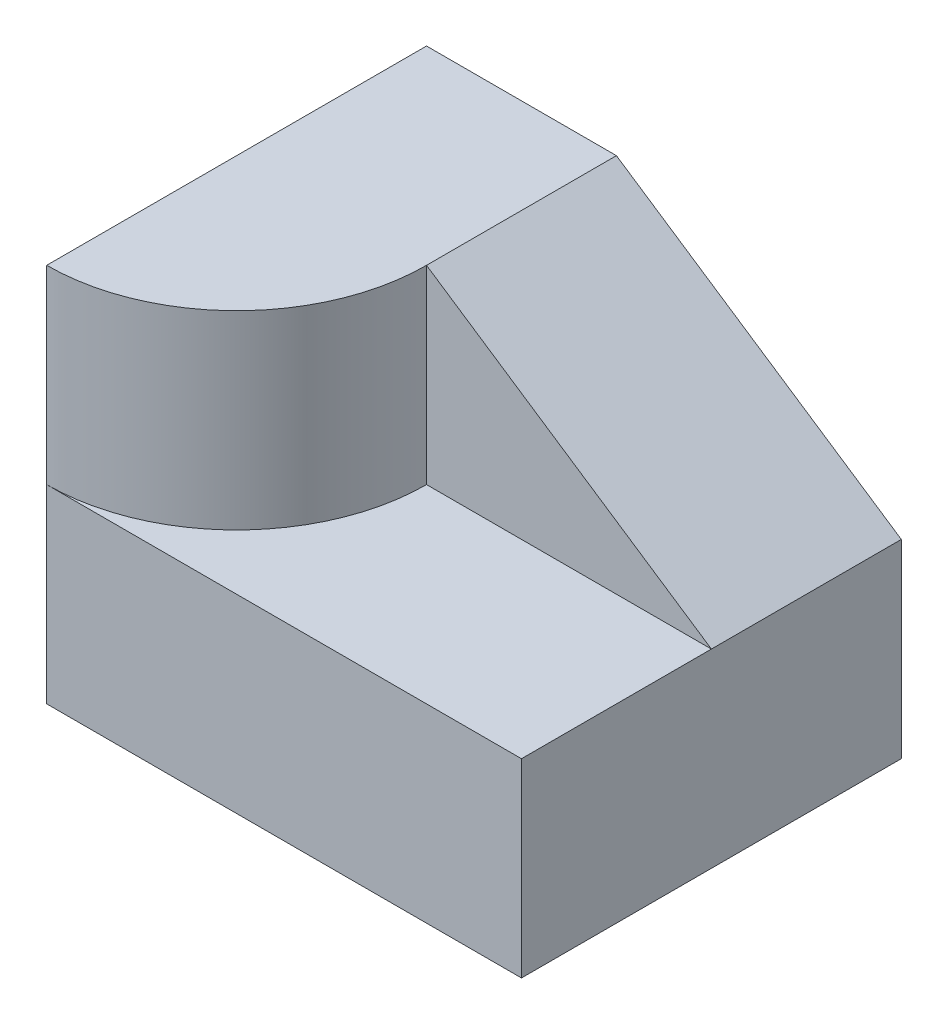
ISO-10303-21;
HEADER;
FILE_DESCRIPTION(('STEP AP214'),'2;1');
FILE_NAME('part.step','',(''),(''),'','','');
FILE_SCHEMA(('AUTOMOTIVE_DESIGN { 1 0 10303 214 1 1 1 1 }'));
ENDSEC;
DATA;
#1=APPLICATION_CONTEXT('core data for automotive mechanical design processes');
#2=APPLICATION_PROTOCOL_DEFINITION('international standard','automotive_design',2000,#1);
#3=PRODUCT_CONTEXT('',#1,'mechanical');
#4=PRODUCT('Part','Part','',(#3));
#5=PRODUCT_RELATED_PRODUCT_CATEGORY('part','',(#4));
#6=PRODUCT_DEFINITION_FORMATION('','',#4);
#7=PRODUCT_DEFINITION_CONTEXT('part definition',#1,'design');
#8=PRODUCT_DEFINITION('design','',#6,#7);
#9=PRODUCT_DEFINITION_SHAPE('','',#8);
#10=(LENGTH_UNIT() NAMED_UNIT(*) SI_UNIT(.MILLI.,.METRE.));
#11=(NAMED_UNIT(*) PLANE_ANGLE_UNIT() SI_UNIT($,.RADIAN.));
#12=(NAMED_UNIT(*) SI_UNIT($,.STERADIAN.) SOLID_ANGLE_UNIT());
#13=UNCERTAINTY_MEASURE_WITH_UNIT(LENGTH_MEASURE(1.E-05),#10,'distance_accuracy_value','');
#14=(GEOMETRIC_REPRESENTATION_CONTEXT(3) GLOBAL_UNCERTAINTY_ASSIGNED_CONTEXT((#13)) GLOBAL_UNIT_ASSIGNED_CONTEXT((#10,
#11,#12)) REPRESENTATION_CONTEXT('',''));
#15=CARTESIAN_POINT('',(0.,0.,0.));
#16=DIRECTION('',(0.,0.,1.));
#17=DIRECTION('',(1.,0.,0.));
#18=AXIS2_PLACEMENT_3D('',#15,#16,#17);
#19=CARTESIAN_POINT('',(25.,20.,20.));
#20=DIRECTION('',(0.,-1.,0.));
#21=DIRECTION('',(1.,0.,0.));
#22=AXIS2_PLACEMENT_3D('',#19,#20,#21);
#23=PLANE('',#22);
#24=DIRECTION('',(0.,0.,-1.));
#25=VECTOR('',#24,1.);
#26=CARTESIAN_POINT('',(50.,20.,20.));
#27=LINE('',#26,#25);
#28=CARTESIAN_POINT('',(50.,20.,20.));
#29=VERTEX_POINT('',#28);
#30=CARTESIAN_POINT('',(50.,20.,0.));
#31=VERTEX_POINT('',#30);
#32=EDGE_CURVE('E132',#29,#31,#27,.T.);
#33=ORIENTED_EDGE('',*,*,#32,.T.);
#34=DIRECTION('',(-1.,0.,0.));
#35=VECTOR('',#34,1.);
#36=CARTESIAN_POINT('',(25.,20.,0.));
#37=LINE('',#36,#35);
#38=CARTESIAN_POINT('',(20.,20.,0.));
#39=VERTEX_POINT('',#38);
#40=EDGE_CURVE('E113',#31,#39,#37,.T.);
#41=ORIENTED_EDGE('',*,*,#40,.T.);
#42=CARTESIAN_POINT('',(0.,20.,0.));
#43=DIRECTION('',(0.,-1.,0.));
#44=DIRECTION('',(1.,0.,0.));
#45=AXIS2_PLACEMENT_3D('',#42,#43,#44);
#46=CIRCLE('',#45,20.);
#47=CARTESIAN_POINT('',(0.,20.,20.));
#48=VERTEX_POINT('',#47);
#49=EDGE_CURVE('E11',#39,#48,#46,.T.);
#50=ORIENTED_EDGE('',*,*,#49,.T.);
#51=DIRECTION('',(-1.,0.,0.));
#52=VECTOR('',#51,1.);
#53=CARTESIAN_POINT('',(25.,20.,20.));
#54=LINE('',#53,#52);
#55=EDGE_CURVE('E47',#29,#48,#54,.T.);
#56=ORIENTED_EDGE('',*,*,#55,.F.);
#57=EDGE_LOOP('',(#33,#41,#50,#56));
#58=FACE_BOUND('',#57,.T.);
#59=ADVANCED_FACE('F32',(#58),#23,.F.);
#60=CARTESIAN_POINT('',(50.,-29.9460396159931,20.));
#61=DIRECTION('',(-1.,0.,0.));
#62=DIRECTION('',(0.,0.,1.));
#63=AXIS2_PLACEMENT_3D('',#60,#61,#62);
#64=PLANE('',#63);
#65=DIRECTION('',(0.,1.,0.));
#66=VECTOR('',#65,1.);
#67=CARTESIAN_POINT('',(50.,-29.9460396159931,-20.));
#68=LINE('',#67,#66);
#69=CARTESIAN_POINT('',(50.,0.,-20.));
#70=VERTEX_POINT('',#69);
#71=CARTESIAN_POINT('',(50.,20.,-20.));
#72=VERTEX_POINT('',#71);
#73=EDGE_CURVE('E111',#70,#72,#68,.T.);
#74=ORIENTED_EDGE('',*,*,#73,.T.);
#75=DIRECTION('',(0.,0.,1.));
#76=VECTOR('',#75,1.);
#77=CARTESIAN_POINT('',(50.,20.,-20.));
#78=LINE('',#77,#76);
#79=EDGE_CURVE('E93',#72,#31,#78,.T.);
#80=ORIENTED_EDGE('',*,*,#79,.T.);
#81=ORIENTED_EDGE('',*,*,#32,.F.);
#82=DIRECTION('',(0.,1.,0.));
#83=VECTOR('',#82,1.);
#84=CARTESIAN_POINT('',(50.,-29.9460396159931,20.));
#85=LINE('',#84,#83);
#86=CARTESIAN_POINT('',(50.,0.,20.));
#87=VERTEX_POINT('',#86);
#88=EDGE_CURVE('E128',#87,#29,#85,.T.);
#89=ORIENTED_EDGE('',*,*,#88,.F.);
#90=DIRECTION('',(0.,0.,-1.));
#91=VECTOR('',#90,1.);
#92=CARTESIAN_POINT('',(50.,0.,20.));
#93=LINE('',#92,#91);
#94=EDGE_CURVE('E117',#87,#70,#93,.T.);
#95=ORIENTED_EDGE('',*,*,#94,.T.);
#96=EDGE_LOOP('',(#74,#80,#81,#89,#95));
#97=FACE_BOUND('',#96,.T.);
#98=ADVANCED_FACE('F115',(#97),#64,.F.);
#99=CARTESIAN_POINT('',(0.,-29.9460396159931,20.));
#100=DIRECTION('',(1.,0.,0.));
#101=DIRECTION('',(0.,1.,0.));
#102=AXIS2_PLACEMENT_3D('',#99,#100,#101);
#103=PLANE('',#102);
#104=DIRECTION('',(0.,-1.,0.));
#105=VECTOR('',#104,1.);
#106=CARTESIAN_POINT('',(0.,-29.9460396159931,-20.));
#107=LINE('',#106,#105);
#108=CARTESIAN_POINT('',(0.,40.,-20.));
#109=VERTEX_POINT('',#108);
#110=CARTESIAN_POINT('',(0.,0.,-20.));
#111=VERTEX_POINT('',#110);
#112=EDGE_CURVE('E118',#109,#111,#107,.T.);
#113=ORIENTED_EDGE('',*,*,#112,.T.);
#114=DIRECTION('',(0.,0.,-1.));
#115=VECTOR('',#114,1.);
#116=CARTESIAN_POINT('',(0.,0.,20.));
#117=LINE('',#116,#115);
#118=CARTESIAN_POINT('',(0.,0.,20.));
#119=VERTEX_POINT('',#118);
#120=EDGE_CURVE('E130',#119,#111,#117,.T.);
#121=ORIENTED_EDGE('',*,*,#120,.F.);
#122=DIRECTION('',(0.,-1.,0.));
#123=VECTOR('',#122,1.);
#124=CARTESIAN_POINT('',(0.,-29.9460396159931,20.));
#125=LINE('',#124,#123);
#126=EDGE_CURVE('E135',#48,#119,#125,.T.);
#127=ORIENTED_EDGE('',*,*,#126,.F.);
#128=CARTESIAN_POINT('',(0.,40.,20.));
#129=VERTEX_POINT('',#128);
#130=EDGE_CURVE('E138',#129,#48,#125,.T.);
#131=ORIENTED_EDGE('',*,*,#130,.F.);
#132=DIRECTION('',(0.,0.,-1.));
#133=VECTOR('',#132,1.);
#134=CARTESIAN_POINT('',(0.,40.,20.));
#135=LINE('',#134,#133);
#136=EDGE_CURVE('E119',#129,#109,#135,.T.);
#137=ORIENTED_EDGE('',*,*,#136,.T.);
#138=EDGE_LOOP('',(#113,#121,#127,#131,#137));
#139=FACE_BOUND('',#138,.T.);
#140=ADVANCED_FACE('F146',(#139),#103,.F.);
#141=CARTESIAN_POINT('',(25.,0.,20.));
#142=DIRECTION('',(0.,1.,0.));
#143=DIRECTION('',(0.,0.,1.));
#144=AXIS2_PLACEMENT_3D('',#141,#142,#143);
#145=PLANE('',#144);
#146=DIRECTION('',(1.,0.,0.));
#147=VECTOR('',#146,1.);
#148=CARTESIAN_POINT('',(25.,0.,-20.));
#149=LINE('',#148,#147);
#150=EDGE_CURVE('E66',#111,#70,#149,.T.);
#151=ORIENTED_EDGE('',*,*,#150,.T.);
#152=ORIENTED_EDGE('',*,*,#94,.F.);
#153=DIRECTION('',(1.,0.,0.));
#154=VECTOR('',#153,1.);
#155=CARTESIAN_POINT('',(25.,0.,20.));
#156=LINE('',#155,#154);
#157=EDGE_CURVE('E52',#119,#87,#156,.T.);
#158=ORIENTED_EDGE('',*,*,#157,.F.);
#159=ORIENTED_EDGE('',*,*,#120,.T.);
#160=EDGE_LOOP('',(#151,#152,#158,#159));
#161=FACE_BOUND('',#160,.T.);
#162=ADVANCED_FACE('F147',(#161),#145,.F.);
#163=CARTESIAN_POINT('',(25.,-29.9460396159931,20.));
#164=DIRECTION('',(0.,0.,1.));
#165=DIRECTION('',(1.,0.,0.));
#166=AXIS2_PLACEMENT_3D('',#163,#164,#165);
#167=PLANE('',#166);
#168=ORIENTED_EDGE('',*,*,#55,.T.);
#169=ORIENTED_EDGE('',*,*,#126,.T.);
#170=ORIENTED_EDGE('',*,*,#157,.T.);
#171=ORIENTED_EDGE('',*,*,#88,.T.);
#172=EDGE_LOOP('',(#168,#169,#170,#171));
#173=FACE_BOUND('',#172,.T.);
#174=ADVANCED_FACE('F144',(#173),#167,.T.);
#175=CARTESIAN_POINT('',(25.,-29.9460396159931,-20.));
#176=DIRECTION('',(0.,0.,1.));
#177=DIRECTION('',(1.,0.,0.));
#178=AXIS2_PLACEMENT_3D('',#175,#176,#177);
#179=PLANE('',#178);
#180=ORIENTED_EDGE('',*,*,#73,.F.);
#181=ORIENTED_EDGE('',*,*,#150,.F.);
#182=ORIENTED_EDGE('',*,*,#112,.F.);
#183=DIRECTION('',(-1.,0.,0.));
#184=VECTOR('',#183,1.);
#185=CARTESIAN_POINT('',(25.,40.,-20.));
#186=LINE('',#185,#184);
#187=CARTESIAN_POINT('',(20.,40.,-20.));
#188=VERTEX_POINT('',#187);
#189=EDGE_CURVE('E104',#188,#109,#186,.T.);
#190=ORIENTED_EDGE('',*,*,#189,.F.);
#191=DIRECTION('',(-0.832050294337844,0.554700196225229,0.));
#192=VECTOR('',#191,1.);
#193=CARTESIAN_POINT('',(55.7443259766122,16.1704493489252,-20.));
#194=LINE('',#193,#192);
#195=EDGE_CURVE('E97',#72,#188,#194,.T.);
#196=ORIENTED_EDGE('',*,*,#195,.F.);
#197=EDGE_LOOP('',(#180,#181,#182,#190,#196));
#198=FACE_BOUND('',#197,.T.);
#199=ADVANCED_FACE('F110',(#198),#179,.F.);
#200=CARTESIAN_POINT('',(25.,40.,20.));
#201=DIRECTION('',(0.,-1.,0.));
#202=DIRECTION('',(0.,0.,-1.));
#203=AXIS2_PLACEMENT_3D('',#200,#201,#202);
#204=PLANE('',#203);
#205=ORIENTED_EDGE('',*,*,#136,.F.);
#206=CARTESIAN_POINT('',(0.,40.,0.));
#207=DIRECTION('',(0.,-1.,0.));
#208=DIRECTION('',(0.,0.,-1.));
#209=AXIS2_PLACEMENT_3D('',#206,#207,#208);
#210=CIRCLE('',#209,20.);
#211=CARTESIAN_POINT('',(20.,40.,0.));
#212=VERTEX_POINT('',#211);
#213=EDGE_CURVE('E40',#129,#212,#210,.F.);
#214=ORIENTED_EDGE('',*,*,#213,.T.);
#215=DIRECTION('',(0.,0.,1.));
#216=VECTOR('',#215,1.);
#217=CARTESIAN_POINT('',(20.,40.,-20.));
#218=LINE('',#217,#216);
#219=EDGE_CURVE('E105',#188,#212,#218,.T.);
#220=ORIENTED_EDGE('',*,*,#219,.F.);
#221=ORIENTED_EDGE('',*,*,#189,.T.);
#222=EDGE_LOOP('',(#205,#214,#220,#221));
#223=FACE_BOUND('',#222,.T.);
#224=ADVANCED_FACE('F159',(#223),#204,.F.);
#225=CARTESIAN_POINT('',(55.7443259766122,16.1704493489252,-20.));
#226=DIRECTION('',(0.554700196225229,0.832050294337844,0.));
#227=DIRECTION('',(-0.832050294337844,0.554700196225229,0.));
#228=AXIS2_PLACEMENT_3D('',#225,#226,#227);
#229=PLANE('',#228);
#230=DIRECTION('',(-0.832050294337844,0.554700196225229,0.));
#231=VECTOR('',#230,1.);
#232=CARTESIAN_POINT('',(55.7443259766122,16.1704493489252,0.));
#233=LINE('',#232,#231);
#234=EDGE_CURVE('E100',#31,#212,#233,.T.);
#235=ORIENTED_EDGE('',*,*,#234,.F.);
#236=ORIENTED_EDGE('',*,*,#79,.F.);
#237=ORIENTED_EDGE('',*,*,#195,.T.);
#238=ORIENTED_EDGE('',*,*,#219,.T.);
#239=EDGE_LOOP('',(#235,#236,#237,#238));
#240=FACE_BOUND('',#239,.T.);
#241=ADVANCED_FACE('F95',(#240),#229,.T.);
#242=CARTESIAN_POINT('',(25.,-29.9460396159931,0.));
#243=DIRECTION('',(0.,0.,1.));
#244=DIRECTION('',(1.,0.,0.));
#245=AXIS2_PLACEMENT_3D('',#242,#243,#244);
#246=PLANE('',#245);
#247=ORIENTED_EDGE('',*,*,#234,.T.);
#248=DIRECTION('',(0.,-1.,0.));
#249=VECTOR('',#248,1.);
#250=CARTESIAN_POINT('',(20.,-29.9460396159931,0.));
#251=LINE('',#250,#249);
#252=EDGE_CURVE('E151',#212,#39,#251,.T.);
#253=ORIENTED_EDGE('',*,*,#252,.T.);
#254=ORIENTED_EDGE('',*,*,#40,.F.);
#255=EDGE_LOOP('',(#247,#253,#254));
#256=FACE_BOUND('',#255,.T.);
#257=ADVANCED_FACE('F161',(#256),#246,.T.);
#258=CARTESIAN_POINT('',(0.,-29.9460396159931,0.));
#259=DIRECTION('',(0.,-1.,0.));
#260=DIRECTION('',(1.,0.,0.));
#261=AXIS2_PLACEMENT_3D('',#258,#259,#260);
#262=CYLINDRICAL_SURFACE('',#261,20.);
#263=ORIENTED_EDGE('',*,*,#213,.F.);
#264=ORIENTED_EDGE('',*,*,#130,.T.);
#265=ORIENTED_EDGE('',*,*,#49,.F.);
#266=ORIENTED_EDGE('',*,*,#252,.F.);
#267=EDGE_LOOP('',(#263,#264,#265,#266));
#268=FACE_BOUND('',#267,.T.);
#269=ADVANCED_FACE('F34',(#268),#262,.T.);
#270=CLOSED_SHELL('',(#59,#98,#140,#162,#174,#199,#224,#241,#257,#269));
#271=MANIFOLD_SOLID_BREP('B2',#270);
#272=ADVANCED_BREP_SHAPE_REPRESENTATION('',(#18,#271),#14);
#273=SHAPE_DEFINITION_REPRESENTATION(#9,#272);
ENDSEC;
END-ISO-10303-21;
